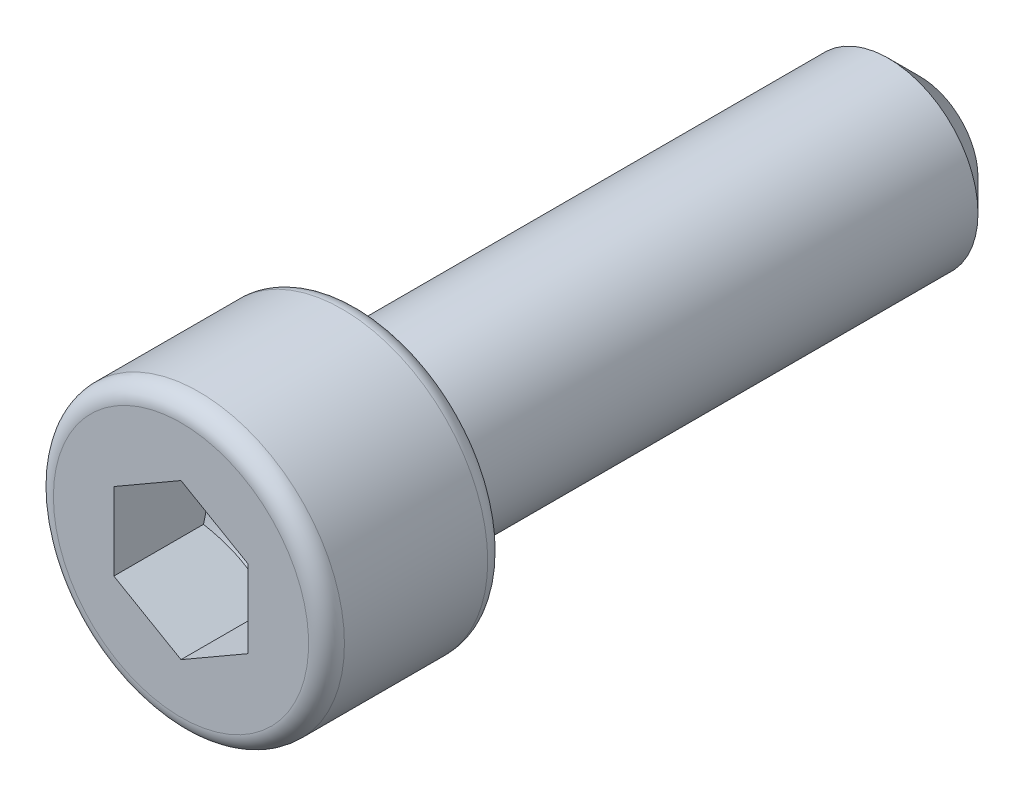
from build123d import *

# Parameters (mm, degrees)
HEX_2_DEPTH        = 4
CUT_EXTRUDE2_DEPTH = 2.219224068
FILLETHEAD_R       = 0.8
CHAMFERROD_SIZE    = 1.4


with BuildPart() as part:
    # Sketch1 → Revolve1 (revolve)
    with BuildSketch(Plane(origin=(0, 0, 0), x_dir=(0, 0, -1), z_dir=(1, 0, 0)), mode=Mode.PRIVATE) as revolve1_sk:
        Polygon((0, 0), (0, 6.5), (8, 6.5), (8, 4), (33, 4), (33, 0), align=None)
    revolve(revolve1_sk.sketch.rotate(Axis((0, 0, 0), (0, 0, -1)), 90), axis=Axis((0, 0, 0), (0, 0, -1)))

    # Sketch2 → Hex 2 (cut)
    with BuildSketch(Plane.XY):
        Polygon((0, 3.464101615), (-3, 1.732050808), (-3, -1.732050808), (0, -3.464101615), (3, -1.732050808), (3, 1.732050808), align=None)
    extrude(amount=-HEX_2_DEPTH, mode=Mode.SUBTRACT)

    # Sketch3 → Cut-Extrude2 (cut)
    with BuildSketch(Plane.XY.offset(-4)):
        Polygon((0, 3.464101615), (-3, 1.732050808), (-3, -1.732050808), (0, -3.464101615), (3, -1.732050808), (3, 1.732050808), align=None)
    extrude(amount=-CUT_EXTRUDE2_DEPTH, mode=Mode.SUBTRACT)

    # Sketch4 → Revolve2 (revolve)
    with BuildSketch(Plane(origin=(0, 0, 0), x_dir=(0, 0, -1), z_dir=(1, 0, 0)), mode=Mode.PRIVATE) as revolve2_sk:
        Polygon((6.219224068, 0), (6.219224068, 3.4671), (4, 3.4671), (6.001731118, 0), align=None)
    revolve(revolve2_sk.sketch.rotate(Axis((0, 0, 0), (0, 0, -1)), 90), axis=Axis((0, 0, 0), (0, 0, -1)))

    # FilletHead
    fillethead_edges = [part.edges().sort_by_distance(p)[0] for p in [
        (-6.5, 0, -8),
        (-6.5, 0, 0),
    ]]
    fillet(fillethead_edges, radius=FILLETHEAD_R)

    # ChamferRod
    chamferrod_edges = [part.edges().sort_by_distance(p)[0] for p in [
        (-4, 0, -33),
    ]]
    chamfer(chamferrod_edges, length=CHAMFERROD_SIZE)


solid = part.part
